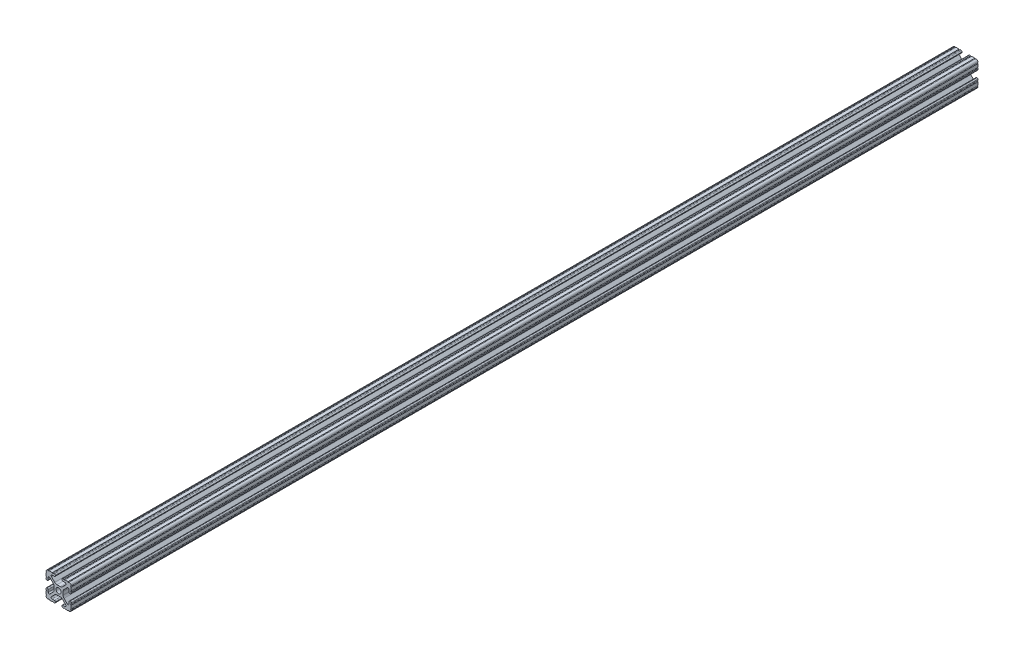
from build123d import *

# Parameters (mm, degrees)
SKETCH1_R           = 2.6035
BOSS_EXTRUDE1_DEPTH = 457.2


with BuildPart() as part:
    # Sketch1 → Boss-Extrude1 (new, symmetric)
    with BuildSketch(Plane.XY):
        with BuildLine():
            Line((-7.179650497, -8.645192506), (-3.952270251, -5.423690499))
            ThreePointArc((-3.952270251, -5.423690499), (-2.922936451, -4.736929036), (-1.709253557, -4.4958))
            Line((-1.709253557, -4.4958), (1.709253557, -4.4958))
            ThreePointArc((1.709253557, -4.4958), (2.922936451, -4.736929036), (3.952270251, -5.423690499))
            Line((3.952270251, -5.423690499), (7.179650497, -8.645192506))
            ThreePointArc((7.179650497, -8.645192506), (7.41473083, -9.822813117), (6.416408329, -10.4902))
            Line((6.416408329, -10.4902), (4.287512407, -10.4902))
            ThreePointArc((4.287512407, -10.4902), (3.54574862, -10.79744862), (3.2385, -11.539212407))
            Line((3.2385, -11.539212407), (3.2385, -11.650987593))
            ThreePointArc((3.2385, -11.650987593), (3.54574862, -12.39275138), (4.287512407, -12.7))
            Line((4.287512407, -12.7), (5.317126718, -12.7))
            ThreePointArc((5.317126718, -12.7), (5.825126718, -12.192), (6.333126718, -12.7))
            Line((6.333126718, -12.7), (9.550443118, -12.7))
            ThreePointArc((9.550443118, -12.7), (10.058366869, -12.192000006), (10.566443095, -12.699847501))
            ThreePointArc((10.566443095, -12.699847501), (12.082537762, -12.08250727), (12.699846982, -10.566399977))
            ThreePointArc((12.699846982, -10.566399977), (12.192000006, -10.058323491), (12.7, -9.5504))
            Line((12.7, -9.5504), (12.7, -6.3330836))
            ThreePointArc((12.7, -6.3330836), (12.192, -5.8250836), (12.7, -5.3170836))
            Line((12.7, -5.3170836), (12.7, -4.287469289))
            ThreePointArc((12.7, -4.287469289), (12.39275138, -3.545705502), (11.650987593, -3.238456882))
            Line((11.650987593, -3.238456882), (11.539212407, -3.238456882))
            ThreePointArc((11.539212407, -3.238456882), (10.79744862, -3.545705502), (10.4902, -4.287469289))
            Line((10.4902, -4.287469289), (10.4902, -6.402089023))
            ThreePointArc((10.4902, -6.402089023), (9.856505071, -7.351067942), (8.737131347, -7.129408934))
            Line((8.737131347, -7.129408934), (5.441005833, -3.840816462))
            ThreePointArc((5.441005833, -3.840816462), (4.750877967, -2.809883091), (4.5085, -1.593185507))
            Line((4.5085, -1.593185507), (4.5085, 1.593185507))
            ThreePointArc((4.5085, 1.593185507), (4.750877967, 2.809883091), (5.441005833, 3.840816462))
            Line((5.441005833, 3.840816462), (8.737131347, 7.129408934))
            ThreePointArc((8.737131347, 7.129408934), (9.856505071, 7.351067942), (10.4902, 6.402089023))
            Line((10.4902, 6.402089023), (10.4902, 4.287469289))
            ThreePointArc((10.4902, 4.287469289), (10.79744862, 3.545705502), (11.539212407, 3.238456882))
            Line((11.539212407, 3.238456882), (11.650987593, 3.238456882))
            ThreePointArc((11.650987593, 3.238456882), (12.39275138, 3.545705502), (12.7, 4.287469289))
            Line((12.7, 4.287469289), (12.7, 5.3170836))
            ThreePointArc((12.7, 5.3170836), (12.192, 5.8250836), (12.7, 6.3330836))
            Line((12.7, 6.3330836), (12.7, 9.5504))
            ThreePointArc((12.7, 9.5504), (12.192000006, 10.058323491), (12.699846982, 10.566399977))
            ThreePointArc((12.699846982, 10.566399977), (12.082537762, 12.08250727), (10.566443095, 12.699847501))
            ThreePointArc((10.566443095, 12.699847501), (10.058366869, 12.192000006), (9.550443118, 12.7))
            Line((9.550443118, 12.7), (6.333126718, 12.7))
            ThreePointArc((6.333126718, 12.7), (5.825126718, 12.192), (5.317126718, 12.7))
            Line((5.317126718, 12.7), (4.287512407, 12.7))
            ThreePointArc((4.287512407, 12.7), (3.54574862, 12.39275138), (3.2385, 11.650987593))
            Line((3.2385, 11.650987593), (3.2385, 11.539212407))
            ThreePointArc((3.2385, 11.539212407), (3.54574862, 10.79744862), (4.287512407, 10.4902))
            Line((4.287512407, 10.4902), (6.476788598, 10.4902))
            ThreePointArc((6.476788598, 10.4902), (7.432222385, 9.85140422), (7.207036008, 8.724370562))
            Line((7.207036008, 8.724370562), (3.898272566, 5.423169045))
            ThreePointArc((3.898272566, 5.423169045), (2.869120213, 4.736787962), (1.655778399, 4.4958))
            Line((1.655778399, 4.4958), (-1.655778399, 4.4958))
            ThreePointArc((-1.655778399, 4.4958), (-2.869120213, 4.736787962), (-3.898272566, 5.423169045))
            Line((-3.898272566, 5.423169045), (-7.207036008, 8.724370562))
            ThreePointArc((-7.207036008, 8.724370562), (-7.432222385, 9.85140422), (-6.476788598, 10.4902))
            Line((-6.476788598, 10.4902), (-4.287512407, 10.4902))
            ThreePointArc((-4.287512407, 10.4902), (-3.54574862, 10.79744862), (-3.2385, 11.539212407))
            Line((-3.2385, 11.539212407), (-3.2385, 11.650987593))
            ThreePointArc((-3.2385, 11.650987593), (-3.54574862, 12.39275138), (-4.287512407, 12.7))
            Line((-4.287512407, 12.7), (-5.317126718, 12.7))
            ThreePointArc((-5.317126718, 12.7), (-5.825126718, 12.192), (-6.333126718, 12.7))
            Line((-6.333126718, 12.7), (-9.550443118, 12.7))
            ThreePointArc((-9.550443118, 12.7), (-10.058366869, 12.192000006), (-10.566443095, 12.699847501))
            ThreePointArc((-10.566443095, 12.699847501), (-12.082537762, 12.08250727), (-12.699846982, 10.566399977))
            ThreePointArc((-12.699846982, 10.566399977), (-12.192000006, 10.058323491), (-12.7, 9.5504))
            Line((-12.7, 9.5504), (-12.7, 6.3330836))
            ThreePointArc((-12.7, 6.3330836), (-12.192, 5.8250836), (-12.7, 5.3170836))
            Line((-12.7, 5.3170836), (-12.7, 4.287469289))
            ThreePointArc((-12.7, 4.287469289), (-12.39275138, 3.545705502), (-11.650987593, 3.238456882))
            Line((-11.650987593, 3.238456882), (-11.539212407, 3.238456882))
            ThreePointArc((-11.539212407, 3.238456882), (-10.79744862, 3.545705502), (-10.4902, 4.287469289))
            Line((-10.4902, 4.287469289), (-10.4902, 6.402089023))
            ThreePointArc((-10.4902, 6.402089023), (-9.856505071, 7.351067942), (-8.737131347, 7.129408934))
            Line((-8.737131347, 7.129408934), (-5.441005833, 3.840816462))
            ThreePointArc((-5.441005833, 3.840816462), (-4.750877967, 2.809883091), (-4.5085, 1.593185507))
            Line((-4.5085, 1.593185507), (-4.5085, -1.593185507))
            ThreePointArc((-4.5085, -1.593185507), (-4.750877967, -2.809883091), (-5.441005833, -3.840816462))
            Line((-5.441005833, -3.840816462), (-8.737131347, -7.129408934))
            ThreePointArc((-8.737131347, -7.129408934), (-9.856505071, -7.351067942), (-10.4902, -6.402089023))
            Line((-10.4902, -6.402089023), (-10.4902, -4.287469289))
            ThreePointArc((-10.4902, -4.287469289), (-10.79744862, -3.545705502), (-11.539212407, -3.238456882))
            Line((-11.539212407, -3.238456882), (-11.650987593, -3.238456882))
            ThreePointArc((-11.650987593, -3.238456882), (-12.39275138, -3.545705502), (-12.7, -4.287469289))
            Line((-12.7, -4.287469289), (-12.7, -5.3170836))
            ThreePointArc((-12.7, -5.3170836), (-12.192, -5.8250836), (-12.7, -6.3330836))
            Line((-12.7, -6.3330836), (-12.7, -9.5504))
            ThreePointArc((-12.7, -9.5504), (-12.192000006, -10.058323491), (-12.699846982, -10.566399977))
            ThreePointArc((-12.699846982, -10.566399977), (-12.082537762, -12.08250727), (-10.566443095, -12.699847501))
            ThreePointArc((-10.566443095, -12.699847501), (-10.058366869, -12.192000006), (-9.550443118, -12.7))
            Line((-9.550443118, -12.7), (-6.333126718, -12.7))
            ThreePointArc((-6.333126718, -12.7), (-5.825126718, -12.192), (-5.317126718, -12.7))
            Line((-5.317126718, -12.7), (-4.287512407, -12.7))
            ThreePointArc((-4.287512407, -12.7), (-3.54574862, -12.39275138), (-3.2385, -11.650987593))
            Line((-3.2385, -11.650987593), (-3.2385, -11.539212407))
            ThreePointArc((-3.2385, -11.539212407), (-3.54574862, -10.79744862), (-4.287512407, -10.4902))
            Line((-4.287512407, -10.4902), (-6.416408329, -10.4902))
            ThreePointArc((-6.416408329, -10.4902), (-7.41473083, -9.822813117), (-7.179650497, -8.645192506))
        make_face()
        Circle(SKETCH1_R, mode=Mode.SUBTRACT)
    extrude(amount=BOSS_EXTRUDE1_DEPTH, both=True)


solid = part.part
